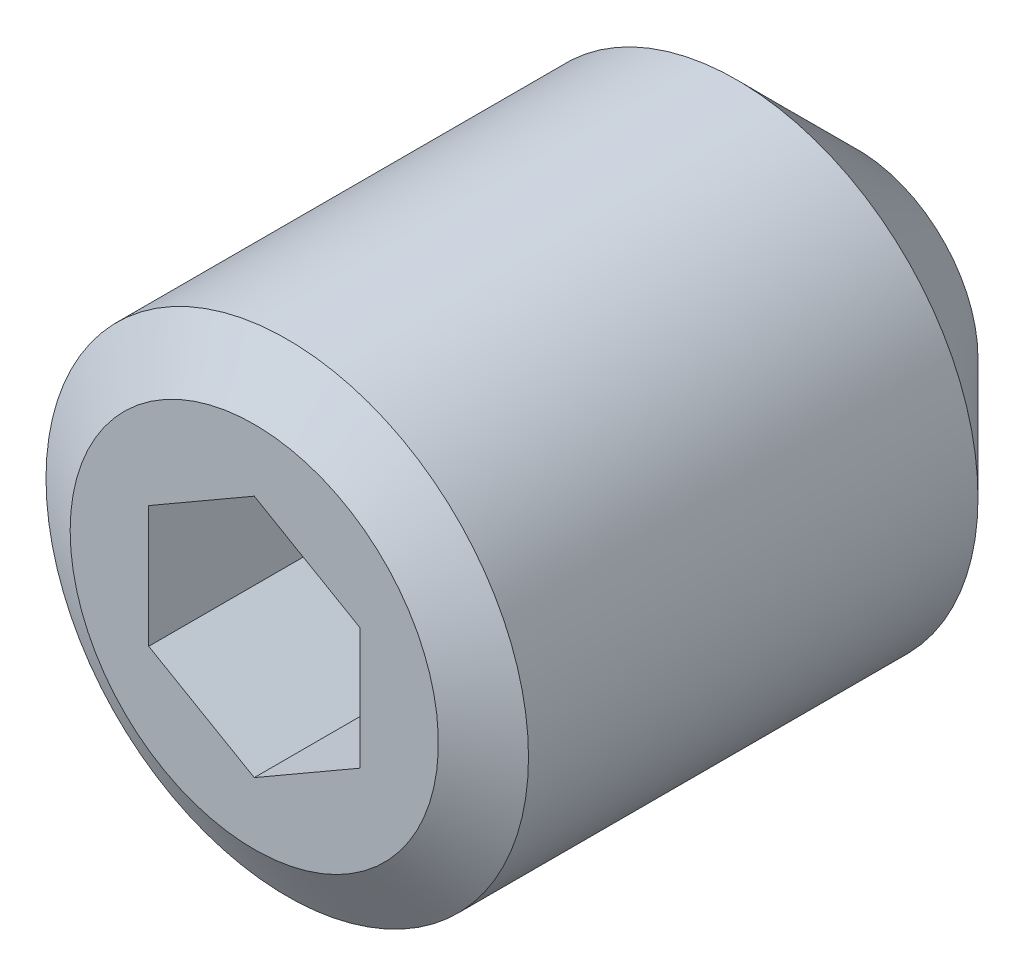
ISO-10303-21;
HEADER;
FILE_DESCRIPTION(('STEP AP214'),'2;1');
FILE_NAME('part.step','',(''),(''),'','','');
FILE_SCHEMA(('AUTOMOTIVE_DESIGN { 1 0 10303 214 1 1 1 1 }'));
ENDSEC;
DATA;
#1=APPLICATION_CONTEXT('core data for automotive mechanical design processes');
#2=APPLICATION_PROTOCOL_DEFINITION('international standard','automotive_design',2000,#1);
#3=PRODUCT_CONTEXT('',#1,'mechanical');
#4=PRODUCT('Part','Part','',(#3));
#5=PRODUCT_RELATED_PRODUCT_CATEGORY('part','',(#4));
#6=PRODUCT_DEFINITION_FORMATION('','',#4);
#7=PRODUCT_DEFINITION_CONTEXT('part definition',#1,'design');
#8=PRODUCT_DEFINITION('design','',#6,#7);
#9=PRODUCT_DEFINITION_SHAPE('','',#8);
#10=(LENGTH_UNIT() NAMED_UNIT(*) SI_UNIT(.MILLI.,.METRE.));
#11=(NAMED_UNIT(*) PLANE_ANGLE_UNIT() SI_UNIT($,.RADIAN.));
#12=(NAMED_UNIT(*) SI_UNIT($,.STERADIAN.) SOLID_ANGLE_UNIT());
#13=UNCERTAINTY_MEASURE_WITH_UNIT(LENGTH_MEASURE(1.E-05),#10,'distance_accuracy_value','');
#14=(GEOMETRIC_REPRESENTATION_CONTEXT(3) GLOBAL_UNCERTAINTY_ASSIGNED_CONTEXT((#13)) GLOBAL_UNIT_ASSIGNED_CONTEXT((#10,
#11,#12)) REPRESENTATION_CONTEXT('',''));
#15=CARTESIAN_POINT('',(0.,0.,0.));
#16=DIRECTION('',(0.,0.,1.));
#17=DIRECTION('',(1.,0.,0.));
#18=AXIS2_PLACEMENT_3D('',#15,#16,#17);
#19=CARTESIAN_POINT('',(0.349999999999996,0.202072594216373,-0.7));
#20=DIRECTION('',(0.500000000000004,0.866025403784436,0.));
#21=DIRECTION('',(-0.866025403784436,0.500000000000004,0.));
#22=AXIS2_PLACEMENT_3D('',#19,#20,#21);
#23=PLANE('',#22);
#24=CARTESIAN_POINT('',(0.350199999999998,0.201957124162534,-0.70013526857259));
#25=CARTESIAN_POINT('',(0.334815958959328,0.21083910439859,-0.705268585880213));
#26=CARTESIAN_POINT('',(0.319299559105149,0.219797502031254,-0.709938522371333));
#27=CARTESIAN_POINT('',(0.287997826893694,0.237869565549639,-0.718091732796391));
#28=CARTESIAN_POINT('',(0.272211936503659,0.246983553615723,-0.721572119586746));
#29=CARTESIAN_POINT('',(0.240835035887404,0.265099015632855,-0.726991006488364));
#30=CARTESIAN_POINT('',(0.225248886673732,0.274097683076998,-0.728965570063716));
#31=CARTESIAN_POINT('',(0.194006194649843,0.292135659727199,-0.731331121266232));
#32=CARTESIAN_POINT('',(0.178349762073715,0.301174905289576,-0.731724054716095));
#33=CARTESIAN_POINT('',(0.135419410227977,0.325960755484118,-0.730550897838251));
#34=CARTESIAN_POINT('',(0.108169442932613,0.341693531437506,-0.727309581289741));
#35=CARTESIAN_POINT('',(0.0674935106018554,0.365177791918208,-0.719313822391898));
#36=CARTESIAN_POINT('',(0.0538146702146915,0.373075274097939,-0.716071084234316));
#37=CARTESIAN_POINT('',(0.0266615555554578,0.388752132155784,-0.708710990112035));
#38=CARTESIAN_POINT('',(0.0131869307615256,0.39653171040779,-0.704595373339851));
#39=CARTESIAN_POINT('',(-0.000200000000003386,0.404260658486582,-0.700135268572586));
#40=B_SPLINE_CURVE_WITH_KNOTS('',3,(#24,#25,#26,#27,#28,#29,#30,#31,#32,#33,#34,#35,#36,#37,#38,
#39),.UNSPECIFIED.,.F.,.F.,(4,2,2,2,2,2,2,4),(0.,0.0554936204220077,0.111120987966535,
0.165370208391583,0.219552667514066,0.314051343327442,0.362406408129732,0.410666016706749),.UNSPECIFIED.);
#41=CARTESIAN_POINT('',(0.349999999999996,0.202072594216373,-0.700201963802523));
#42=VERTEX_POINT('',#41);
#43=CARTESIAN_POINT('',(0.,0.404145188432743,-0.700201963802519));
#44=VERTEX_POINT('',#43);
#45=EDGE_CURVE('E53',#42,#44,#40,.T.);
#46=ORIENTED_EDGE('',*,*,#45,.F.);
#47=DIRECTION('',(0.,0.,1.));
#48=VECTOR('',#47,1.);
#49=CARTESIAN_POINT('',(0.349999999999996,0.202072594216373,-0.7));
#50=LINE('',#49,#48);
#51=CARTESIAN_POINT('',(0.349999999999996,0.202072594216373,0.));
#52=VERTEX_POINT('',#51);
#53=EDGE_CURVE('E211',#42,#52,#50,.T.);
#54=ORIENTED_EDGE('',*,*,#53,.T.);
#55=DIRECTION('',(-0.866025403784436,0.500000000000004,0.));
#56=VECTOR('',#55,1.);
#57=CARTESIAN_POINT('',(0.349999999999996,0.202072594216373,0.));
#58=LINE('',#57,#56);
#59=CARTESIAN_POINT('',(0.,0.404145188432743,0.));
#60=VERTEX_POINT('',#59);
#61=EDGE_CURVE('E192',#52,#60,#58,.T.);
#62=ORIENTED_EDGE('',*,*,#61,.T.);
#63=DIRECTION('',(0.,0.,1.));
#64=VECTOR('',#63,1.);
#65=CARTESIAN_POINT('',(0.,0.404145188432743,-0.7));
#66=LINE('',#65,#64);
#67=EDGE_CURVE('E210',#44,#60,#66,.T.);
#68=ORIENTED_EDGE('',*,*,#67,.F.);
#69=EDGE_LOOP('',(#46,#54,#62,#68));
#70=FACE_BOUND('',#69,.T.);
#71=ADVANCED_FACE('F38',(#70),#23,.F.);
#72=CARTESIAN_POINT('',(0.349999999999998,-0.202072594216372,-0.7));
#73=DIRECTION('',(1.,0.,0.));
#74=DIRECTION('',(0.,1.,0.));
#75=AXIS2_PLACEMENT_3D('',#72,#73,#74);
#76=PLANE('',#75);
#77=CARTESIAN_POINT('',(0.349999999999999,-0.523390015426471,-0.570016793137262));
#78=CARTESIAN_POINT('',(0.349999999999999,-0.493147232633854,-0.58448680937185));
#79=CARTESIAN_POINT('',(0.349999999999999,-0.462770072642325,-0.598716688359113));
#80=CARTESIAN_POINT('',(0.349999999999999,-0.401392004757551,-0.626280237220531));
#81=CARTESIAN_POINT('',(0.349999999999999,-0.370388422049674,-0.639607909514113));
#82=CARTESIAN_POINT('',(0.349999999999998,-0.306949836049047,-0.665090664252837));
#83=CARTESIAN_POINT('',(0.349999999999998,-0.274498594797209,-0.677206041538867));
#84=CARTESIAN_POINT('',(0.349999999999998,-0.208759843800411,-0.698764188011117));
#85=CARTESIAN_POINT('',(0.349999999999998,-0.175474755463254,-0.708213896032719));
#86=CARTESIAN_POINT('',(0.349999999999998,-0.124877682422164,-0.719174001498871));
#87=CARTESIAN_POINT('',(0.349999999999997,-0.107917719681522,-0.722290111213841));
#88=CARTESIAN_POINT('',(0.349999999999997,-0.0738074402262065,-0.727238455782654));
#89=CARTESIAN_POINT('',(0.349999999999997,-0.0566571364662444,-0.729070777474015));
#90=CARTESIAN_POINT('',(0.349999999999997,-0.0224688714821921,-0.73128088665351));
#91=CARTESIAN_POINT('',(0.349999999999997,-0.00543206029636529,-0.731675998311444));
#92=CARTESIAN_POINT('',(0.349999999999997,0.0286173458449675,-0.731027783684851));
#93=CARTESIAN_POINT('',(0.349999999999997,0.045629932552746,-0.729984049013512));
#94=CARTESIAN_POINT('',(0.349999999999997,0.112601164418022,-0.723164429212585));
#95=CARTESIAN_POINT('',(0.349999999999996,0.162027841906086,-0.712127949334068));
#96=CARTESIAN_POINT('',(0.349999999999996,0.23498193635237,-0.690460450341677));
#97=CARTESIAN_POINT('',(0.349999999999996,0.259379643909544,-0.682258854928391));
#98=CARTESIAN_POINT('',(0.349999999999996,0.307750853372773,-0.664671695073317));
#99=CARTESIAN_POINT('',(0.349999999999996,0.331724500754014,-0.655286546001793));
#100=CARTESIAN_POINT('',(0.349999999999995,0.392712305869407,-0.630201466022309));
#101=CARTESIAN_POINT('',(0.349999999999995,0.429480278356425,-0.613917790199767));
#102=CARTESIAN_POINT('',(0.349999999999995,0.502491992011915,-0.580205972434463));
#103=CARTESIAN_POINT('',(0.349999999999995,0.538735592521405,-0.562777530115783));
#104=CARTESIAN_POINT('',(0.349999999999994,0.610909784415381,-0.527186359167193));
#105=CARTESIAN_POINT('',(0.349999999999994,0.646839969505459,-0.509022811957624));
#106=CARTESIAN_POINT('',(0.349999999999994,0.71845937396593,-0.472225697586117));
#107=CARTESIAN_POINT('',(0.349999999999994,0.754148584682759,-0.453592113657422));
#108=CARTESIAN_POINT('',(0.349999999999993,0.854236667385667,-0.400766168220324));
#109=CARTESIAN_POINT('',(0.349999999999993,0.918444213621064,-0.366211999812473));
#110=CARTESIAN_POINT('',(0.349999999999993,1.01444060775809,-0.31399767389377));
#111=CARTESIAN_POINT('',(0.349999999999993,1.04634673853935,-0.29655137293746));
#112=CARTESIAN_POINT('',(0.349999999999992,1.11009448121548,-0.261545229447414));
#113=CARTESIAN_POINT('',(0.349999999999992,1.14193609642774,-0.243985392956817));
#114=CARTESIAN_POINT('',(0.349999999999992,1.17375370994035,-0.226381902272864));
#115=B_SPLINE_CURVE_WITH_KNOTS('',3,(#77,#78,#79,#80,#81,#82,#83,#84,#85,#86,#87,#88,#89,#90,
#91,#92,#93,#94,#95,#96,#97,#98,#99,#100,#101,#102,#103,#104,#105,#106,#107,#108,#109,#110,#111,
#112,#113,#114),.UNSPECIFIED.,.F.,.F.,(4,2,2,2,2,2,2,2,2,2,2,2,2,2,2,2,2,2,4),(0.,
0.100605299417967,0.201824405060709,0.305686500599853,0.409275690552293,0.46096695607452,
0.512654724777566,0.563717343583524,0.614794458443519,0.765603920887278,0.842832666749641,
0.920034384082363,1.04064022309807,1.16127783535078,1.28205369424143,1.402833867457,
1.62157221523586,1.73066561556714,1.83975325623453),.UNSPECIFIED.);
#116=CARTESIAN_POINT('',(0.349999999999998,-0.202072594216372,-0.700201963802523));
#117=VERTEX_POINT('',#116);
#118=EDGE_CURVE('E60',#117,#42,#115,.T.);
#119=ORIENTED_EDGE('',*,*,#118,.F.);
#120=DIRECTION('',(0.,0.,1.));
#121=VECTOR('',#120,1.);
#122=CARTESIAN_POINT('',(0.349999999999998,-0.202072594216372,-0.7));
#123=LINE('',#122,#121);
#124=CARTESIAN_POINT('',(0.349999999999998,-0.202072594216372,0.));
#125=VERTEX_POINT('',#124);
#126=EDGE_CURVE('E213',#117,#125,#123,.T.);
#127=ORIENTED_EDGE('',*,*,#126,.T.);
#128=DIRECTION('',(0.,1.,0.));
#129=VECTOR('',#128,1.);
#130=CARTESIAN_POINT('',(0.349999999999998,-0.202072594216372,0.));
#131=LINE('',#130,#129);
#132=EDGE_CURVE('E207',#125,#52,#131,.T.);
#133=ORIENTED_EDGE('',*,*,#132,.T.);
#134=ORIENTED_EDGE('',*,*,#53,.F.);
#135=EDGE_LOOP('',(#119,#127,#133,#134));
#136=FACE_BOUND('',#135,.T.);
#137=ADVANCED_FACE('F165',(#136),#76,.F.);
#138=CARTESIAN_POINT('',(0.,-0.40414518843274,-0.7));
#139=DIRECTION('',(0.499999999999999,-0.866025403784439,0.));
#140=DIRECTION('',(0.866025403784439,0.499999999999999,0.));
#141=AXIS2_PLACEMENT_3D('',#138,#139,#140);
#142=PLANE('',#141);
#143=CARTESIAN_POINT('',(-0.000200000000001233,-0.404260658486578,-0.700135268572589));
#144=CARTESIAN_POINT('',(0.015184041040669,-0.395378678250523,-0.705268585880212));
#145=CARTESIAN_POINT('',(0.0307004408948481,-0.386420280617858,-0.709938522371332));
#146=CARTESIAN_POINT('',(0.0620021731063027,-0.368348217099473,-0.71809173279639));
#147=CARTESIAN_POINT('',(0.0777880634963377,-0.359234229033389,-0.721572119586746));
#148=CARTESIAN_POINT('',(0.109164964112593,-0.341118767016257,-0.726991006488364));
#149=CARTESIAN_POINT('',(0.124751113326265,-0.332120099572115,-0.728965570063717));
#150=CARTESIAN_POINT('',(0.155993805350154,-0.314082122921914,-0.731331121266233));
#151=CARTESIAN_POINT('',(0.171650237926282,-0.305042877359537,-0.731724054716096));
#152=CARTESIAN_POINT('',(0.21458058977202,-0.280257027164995,-0.730550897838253));
#153=CARTESIAN_POINT('',(0.241830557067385,-0.264524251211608,-0.727309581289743));
#154=CARTESIAN_POINT('',(0.282506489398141,-0.241039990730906,-0.7193138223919));
#155=CARTESIAN_POINT('',(0.296185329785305,-0.233142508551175,-0.716071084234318));
#156=CARTESIAN_POINT('',(0.323338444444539,-0.21746565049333,-0.708710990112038));
#157=CARTESIAN_POINT('',(0.336813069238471,-0.209686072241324,-0.704595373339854));
#158=CARTESIAN_POINT('',(0.3502,-0.201957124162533,-0.700135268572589));
#159=B_SPLINE_CURVE_WITH_KNOTS('',3,(#143,#144,#145,#146,#147,#148,#149,#150,#151,#152,#153,
#154,#155,#156,#157,#158),.UNSPECIFIED.,.F.,.F.,(4,2,2,2,2,2,2,4),(0.,0.055493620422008,
0.111120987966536,0.165370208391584,0.219552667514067,0.314051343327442,0.362406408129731,
0.410666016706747),.UNSPECIFIED.);
#160=CARTESIAN_POINT('',(0.,-0.40414518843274,-0.700201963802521));
#161=VERTEX_POINT('',#160);
#162=EDGE_CURVE('E182',#161,#117,#159,.T.);
#163=ORIENTED_EDGE('',*,*,#162,.F.);
#164=DIRECTION('',(0.,0.,1.));
#165=VECTOR('',#164,1.);
#166=CARTESIAN_POINT('',(0.,-0.40414518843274,-0.7));
#167=LINE('',#166,#165);
#168=CARTESIAN_POINT('',(0.,-0.40414518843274,0.));
#169=VERTEX_POINT('',#168);
#170=EDGE_CURVE('E215',#161,#169,#167,.T.);
#171=ORIENTED_EDGE('',*,*,#170,.T.);
#172=DIRECTION('',(0.866025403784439,0.499999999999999,0.));
#173=VECTOR('',#172,1.);
#174=CARTESIAN_POINT('',(0.,-0.40414518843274,0.));
#175=LINE('',#174,#173);
#176=EDGE_CURVE('E204',#169,#125,#175,.T.);
#177=ORIENTED_EDGE('',*,*,#176,.T.);
#178=ORIENTED_EDGE('',*,*,#126,.F.);
#179=EDGE_LOOP('',(#163,#171,#177,#178));
#180=FACE_BOUND('',#179,.T.);
#181=ADVANCED_FACE('F169',(#180),#142,.F.);
#182=CARTESIAN_POINT('',(-0.350000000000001,-0.20207259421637,-0.7));
#183=DIRECTION('',(-0.500000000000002,-0.866025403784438,0.));
#184=DIRECTION('',(0.866025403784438,-0.500000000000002,0.));
#185=AXIS2_PLACEMENT_3D('',#182,#183,#184);
#186=PLANE('',#185);
#187=CARTESIAN_POINT('',(-0.350200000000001,-0.201957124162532,-0.700135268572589));
#188=CARTESIAN_POINT('',(-0.334815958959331,-0.210839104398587,-0.705268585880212));
#189=CARTESIAN_POINT('',(-0.319299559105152,-0.219797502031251,-0.709938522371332));
#190=CARTESIAN_POINT('',(-0.287997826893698,-0.237869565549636,-0.71809173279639));
#191=CARTESIAN_POINT('',(-0.272211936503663,-0.246983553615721,-0.721572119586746));
#192=CARTESIAN_POINT('',(-0.240835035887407,-0.265099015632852,-0.726991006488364));
#193=CARTESIAN_POINT('',(-0.225248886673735,-0.274097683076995,-0.728965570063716));
#194=CARTESIAN_POINT('',(-0.194006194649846,-0.292135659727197,-0.731331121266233));
#195=CARTESIAN_POINT('',(-0.178349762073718,-0.301174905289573,-0.731724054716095));
#196=CARTESIAN_POINT('',(-0.13541941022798,-0.325960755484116,-0.730550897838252));
#197=CARTESIAN_POINT('',(-0.108169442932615,-0.341693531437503,-0.727309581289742));
#198=CARTESIAN_POINT('',(-0.0674935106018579,-0.365177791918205,-0.719313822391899));
#199=CARTESIAN_POINT('',(-0.0538146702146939,-0.373075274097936,-0.716071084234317));
#200=CARTESIAN_POINT('',(-0.0266615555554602,-0.388752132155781,-0.708710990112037));
#201=CARTESIAN_POINT('',(-0.0131869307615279,-0.396531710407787,-0.704595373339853));
#202=CARTESIAN_POINT('',(0.00020000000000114,-0.404260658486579,-0.700135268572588));
#203=B_SPLINE_CURVE_WITH_KNOTS('',3,(#187,#188,#189,#190,#191,#192,#193,#194,#195,#196,#197,
#198,#199,#200,#201,#202),.UNSPECIFIED.,.F.,.F.,(4,2,2,2,2,2,2,4),(0.,0.0554936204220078,
0.111120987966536,0.165370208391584,0.219552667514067,0.314051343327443,0.362406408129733,
0.41066601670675),.UNSPECIFIED.);
#204=CARTESIAN_POINT('',(-0.350000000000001,-0.20207259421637,-0.700201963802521));
#205=VERTEX_POINT('',#204);
#206=EDGE_CURVE('E107',#205,#161,#203,.T.);
#207=ORIENTED_EDGE('',*,*,#206,.F.);
#208=DIRECTION('',(0.,0.,1.));
#209=VECTOR('',#208,1.);
#210=CARTESIAN_POINT('',(-0.350000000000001,-0.20207259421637,-0.7));
#211=LINE('',#210,#209);
#212=CARTESIAN_POINT('',(-0.350000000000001,-0.20207259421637,0.));
#213=VERTEX_POINT('',#212);
#214=EDGE_CURVE('E217',#205,#213,#211,.T.);
#215=ORIENTED_EDGE('',*,*,#214,.T.);
#216=DIRECTION('',(0.866025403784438,-0.500000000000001,0.));
#217=VECTOR('',#216,1.);
#218=CARTESIAN_POINT('',(-0.350000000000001,-0.20207259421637,0.));
#219=LINE('',#218,#217);
#220=EDGE_CURVE('E201',#213,#169,#219,.T.);
#221=ORIENTED_EDGE('',*,*,#220,.T.);
#222=ORIENTED_EDGE('',*,*,#170,.F.);
#223=EDGE_LOOP('',(#207,#215,#221,#222));
#224=FACE_BOUND('',#223,.T.);
#225=ADVANCED_FACE('F130',(#224),#186,.F.);
#226=CARTESIAN_POINT('',(-0.35,0.202072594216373,-0.7));
#227=DIRECTION('',(-1.,0.,0.));
#228=DIRECTION('',(0.,-1.,0.));
#229=AXIS2_PLACEMENT_3D('',#226,#227,#228);
#230=PLANE('',#229);
#231=CARTESIAN_POINT('',(-0.350000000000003,-0.523390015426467,-0.570016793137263));
#232=CARTESIAN_POINT('',(-0.350000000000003,-0.493147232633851,-0.58448680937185));
#233=CARTESIAN_POINT('',(-0.350000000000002,-0.462770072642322,-0.598716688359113));
#234=CARTESIAN_POINT('',(-0.350000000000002,-0.401392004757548,-0.626280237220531));
#235=CARTESIAN_POINT('',(-0.350000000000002,-0.370388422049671,-0.639607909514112));
#236=CARTESIAN_POINT('',(-0.350000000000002,-0.306949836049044,-0.665090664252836));
#237=CARTESIAN_POINT('',(-0.350000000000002,-0.274498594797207,-0.677206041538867));
#238=CARTESIAN_POINT('',(-0.350000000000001,-0.20875984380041,-0.698764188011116));
#239=CARTESIAN_POINT('',(-0.350000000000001,-0.175474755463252,-0.708213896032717));
#240=CARTESIAN_POINT('',(-0.350000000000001,-0.124877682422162,-0.71917400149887));
#241=CARTESIAN_POINT('',(-0.350000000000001,-0.10791771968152,-0.722290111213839));
#242=CARTESIAN_POINT('',(-0.350000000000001,-0.0738074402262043,-0.727238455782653));
#243=CARTESIAN_POINT('',(-0.350000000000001,-0.056657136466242,-0.729070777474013));
#244=CARTESIAN_POINT('',(-0.350000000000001,-0.0224688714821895,-0.731280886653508));
#245=CARTESIAN_POINT('',(-0.35,-0.00543206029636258,-0.731675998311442));
#246=CARTESIAN_POINT('',(-0.35,0.0286173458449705,-0.731027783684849));
#247=CARTESIAN_POINT('',(-0.35,0.0456299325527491,-0.72998404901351));
#248=CARTESIAN_POINT('',(-0.35,0.112601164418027,-0.723164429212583));
#249=CARTESIAN_POINT('',(-0.35,0.162027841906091,-0.712127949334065));
#250=CARTESIAN_POINT('',(-0.349999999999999,0.234981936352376,-0.690460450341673));
#251=CARTESIAN_POINT('',(-0.349999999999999,0.25937964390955,-0.682258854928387));
#252=CARTESIAN_POINT('',(-0.349999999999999,0.30775085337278,-0.664671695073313));
#253=CARTESIAN_POINT('',(-0.349999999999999,0.331724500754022,-0.655286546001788));
#254=CARTESIAN_POINT('',(-0.349999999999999,0.392712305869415,-0.630201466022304));
#255=CARTESIAN_POINT('',(-0.349999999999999,0.429480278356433,-0.613917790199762));
#256=CARTESIAN_POINT('',(-0.349999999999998,0.502491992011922,-0.580205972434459));
#257=CARTESIAN_POINT('',(-0.349999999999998,0.538735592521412,-0.562777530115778));
#258=CARTESIAN_POINT('',(-0.349999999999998,0.610909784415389,-0.527186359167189));
#259=CARTESIAN_POINT('',(-0.349999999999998,0.646839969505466,-0.50902281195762));
#260=CARTESIAN_POINT('',(-0.349999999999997,0.718459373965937,-0.472225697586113));
#261=CARTESIAN_POINT('',(-0.349999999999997,0.754148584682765,-0.453592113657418));
#262=CARTESIAN_POINT('',(-0.349999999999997,0.854236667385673,-0.40076616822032));
#263=CARTESIAN_POINT('',(-0.349999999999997,0.91844421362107,-0.366211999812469));
#264=CARTESIAN_POINT('',(-0.349999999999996,1.0144406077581,-0.313997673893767));
#265=CARTESIAN_POINT('',(-0.349999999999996,1.04634673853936,-0.296551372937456));
#266=CARTESIAN_POINT('',(-0.349999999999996,1.11009448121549,-0.26154522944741));
#267=CARTESIAN_POINT('',(-0.349999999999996,1.14193609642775,-0.243985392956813));
#268=CARTESIAN_POINT('',(-0.349999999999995,1.17375370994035,-0.22638190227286));
#269=B_SPLINE_CURVE_WITH_KNOTS('',3,(#231,#232,#233,#234,#235,#236,#237,#238,#239,#240,#241,
#242,#243,#244,#245,#246,#247,#248,#249,#250,#251,#252,#253,#254,#255,#256,#257,#258,#259,#260,
#261,#262,#263,#264,#265,#266,#267,#268),.UNSPECIFIED.,.F.,.F.,(4,2,2,2,2,2,2,2,2,2,2,2,2,2,2,2,
2,2,4),(0.,0.100605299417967,0.201824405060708,0.305686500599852,0.409275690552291,
0.460966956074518,0.512654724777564,0.563717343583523,0.614794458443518,0.76560392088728,
0.842832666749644,0.920034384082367,1.04064022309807,1.16127783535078,1.28205369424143,
1.402833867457,1.62157221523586,1.73066561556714,1.83975325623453),.UNSPECIFIED.);
#270=CARTESIAN_POINT('',(-0.349999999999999,0.202072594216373,-0.700201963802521));
#271=VERTEX_POINT('',#270);
#272=EDGE_CURVE('E104',#271,#205,#269,.F.);
#273=ORIENTED_EDGE('',*,*,#272,.F.);
#274=DIRECTION('',(0.,0.,1.));
#275=VECTOR('',#274,1.);
#276=CARTESIAN_POINT('',(-0.35,0.202072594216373,-0.7));
#277=LINE('',#276,#275);
#278=CARTESIAN_POINT('',(-0.35,0.202072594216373,0.));
#279=VERTEX_POINT('',#278);
#280=EDGE_CURVE('E219',#271,#279,#277,.T.);
#281=ORIENTED_EDGE('',*,*,#280,.T.);
#282=DIRECTION('',(0.,-1.,0.));
#283=VECTOR('',#282,1.);
#284=CARTESIAN_POINT('',(-0.35,0.202072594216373,0.));
#285=LINE('',#284,#283);
#286=EDGE_CURVE('E198',#279,#213,#285,.T.);
#287=ORIENTED_EDGE('',*,*,#286,.T.);
#288=ORIENTED_EDGE('',*,*,#214,.F.);
#289=EDGE_LOOP('',(#273,#281,#287,#288));
#290=FACE_BOUND('',#289,.T.);
#291=ADVANCED_FACE('F125',(#290),#230,.F.);
#292=CARTESIAN_POINT('',(0.,0.404145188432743,-0.7));
#293=DIRECTION('',(-0.500000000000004,0.866025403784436,0.));
#294=DIRECTION('',(-0.866025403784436,-0.500000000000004,0.));
#295=AXIS2_PLACEMENT_3D('',#292,#293,#294);
#296=PLANE('',#295);
#297=CARTESIAN_POINT('',(0.000199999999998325,0.404260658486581,-0.700135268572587));
#298=CARTESIAN_POINT('',(-0.0151840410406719,0.395378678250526,-0.70526858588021));
#299=CARTESIAN_POINT('',(-0.0307004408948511,0.386420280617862,-0.70993852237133));
#300=CARTESIAN_POINT('',(-0.0620021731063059,0.368348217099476,-0.718091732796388));
#301=CARTESIAN_POINT('',(-0.0777880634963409,0.359234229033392,-0.721572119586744));
#302=CARTESIAN_POINT('',(-0.109164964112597,0.34111876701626,-0.726991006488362));
#303=CARTESIAN_POINT('',(-0.124751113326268,0.332120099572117,-0.728965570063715));
#304=CARTESIAN_POINT('',(-0.155993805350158,0.314082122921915,-0.731331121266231));
#305=CARTESIAN_POINT('',(-0.171650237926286,0.305042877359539,-0.731724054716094));
#306=CARTESIAN_POINT('',(-0.214580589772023,0.280257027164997,-0.730550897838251));
#307=CARTESIAN_POINT('',(-0.241830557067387,0.26452425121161,-0.727309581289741));
#308=CARTESIAN_POINT('',(-0.282506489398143,0.241039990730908,-0.719313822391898));
#309=CARTESIAN_POINT('',(-0.296185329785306,0.233142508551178,-0.716071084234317));
#310=CARTESIAN_POINT('',(-0.323338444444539,0.217465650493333,-0.708710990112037));
#311=CARTESIAN_POINT('',(-0.336813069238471,0.209686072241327,-0.704595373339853));
#312=CARTESIAN_POINT('',(-0.3502,0.201957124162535,-0.700135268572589));
#313=B_SPLINE_CURVE_WITH_KNOTS('',3,(#297,#298,#299,#300,#301,#302,#303,#304,#305,#306,#307,
#308,#309,#310,#311,#312),.UNSPECIFIED.,.F.,.F.,(4,2,2,2,2,2,2,4),(0.,0.0554936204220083,
0.111120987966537,0.165370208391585,0.219552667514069,0.314051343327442,0.36240640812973,
0.410666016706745),.UNSPECIFIED.);
#314=EDGE_CURVE('E142',#44,#271,#313,.T.);
#315=ORIENTED_EDGE('',*,*,#314,.F.);
#316=ORIENTED_EDGE('',*,*,#67,.T.);
#317=DIRECTION('',(-0.866025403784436,-0.500000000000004,0.));
#318=VECTOR('',#317,1.);
#319=CARTESIAN_POINT('',(0.,0.404145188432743,0.));
#320=LINE('',#319,#318);
#321=EDGE_CURVE('E195',#60,#279,#320,.T.);
#322=ORIENTED_EDGE('',*,*,#321,.T.);
#323=ORIENTED_EDGE('',*,*,#280,.F.);
#324=EDGE_LOOP('',(#315,#316,#322,#323));
#325=FACE_BOUND('',#324,.T.);
#326=ADVANCED_FACE('F129',(#325),#296,.F.);
#327=CARTESIAN_POINT('',(0.,0.,0.));
#328=DIRECTION('',(0.,0.,-1.));
#329=DIRECTION('',(-1.,0.,0.));
#330=AXIS2_PLACEMENT_3D('',#327,#328,#329);
#331=PLANE('',#330);
#332=CARTESIAN_POINT('',(0.,0.,0.));
#333=DIRECTION('',(0.,0.,-1.));
#334=DIRECTION('',(-1.,0.,0.));
#335=AXIS2_PLACEMENT_3D('',#332,#333,#334);
#336=CIRCLE('',#335,0.610513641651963);
#337=CARTESIAN_POINT('',(-0.610513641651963,0.,0.));
#338=VERTEX_POINT('',#337);
#339=EDGE_CURVE('E46',#338,#338,#336,.F.);
#340=ORIENTED_EDGE('',*,*,#339,.T.);
#341=EDGE_LOOP('',(#340));
#342=FACE_BOUND('',#341,.T.);
#343=ORIENTED_EDGE('',*,*,#321,.F.);
#344=ORIENTED_EDGE('',*,*,#61,.F.);
#345=ORIENTED_EDGE('',*,*,#132,.F.);
#346=ORIENTED_EDGE('',*,*,#176,.F.);
#347=ORIENTED_EDGE('',*,*,#220,.F.);
#348=ORIENTED_EDGE('',*,*,#286,.F.);
#349=EDGE_LOOP('',(#343,#344,#345,#346,#347,#348));
#350=FACE_BOUND('',#349,.T.);
#351=ADVANCED_FACE('F137',(#342,#350),#331,.F.);
#352=CARTESIAN_POINT('',(0.,0.,43.1034775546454));
#353=DIRECTION('',(0.,0.,1.));
#354=DIRECTION('',(1.,0.,0.));
#355=AXIS2_PLACEMENT_3D('',#352,#353,#354);
#356=CYLINDRICAL_SURFACE('',#355,0.799999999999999);
#357=CARTESIAN_POINT('',(0.,0.,-0.109400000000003));
#358=DIRECTION('',(0.,0.,-1.));
#359=DIRECTION('',(-1.,0.,0.));
#360=AXIS2_PLACEMENT_3D('',#357,#358,#359);
#361=CIRCLE('',#360,0.799999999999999);
#362=CARTESIAN_POINT('',(-0.799999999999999,0.,-0.109400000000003));
#363=VERTEX_POINT('',#362);
#364=EDGE_CURVE('E11',#363,#363,#361,.T.);
#365=ORIENTED_EDGE('',*,*,#364,.T.);
#366=EDGE_LOOP('',(#365));
#367=FACE_BOUND('',#366,.T.);
#368=CARTESIAN_POINT('',(0.,0.,-1.60000000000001));
#369=DIRECTION('',(0.,0.,1.));
#370=DIRECTION('',(1.,0.,0.));
#371=AXIS2_PLACEMENT_3D('',#368,#369,#370);
#372=CIRCLE('',#371,0.799999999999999);
#373=CARTESIAN_POINT('',(0.799999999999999,0.,-1.60000000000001));
#374=VERTEX_POINT('',#373);
#375=EDGE_CURVE('E149',#374,#374,#372,.T.);
#376=ORIENTED_EDGE('',*,*,#375,.T.);
#377=EDGE_LOOP('',(#376));
#378=FACE_BOUND('',#377,.T.);
#379=ADVANCED_FACE('F253',(#367,#378),#356,.T.);
#380=CARTESIAN_POINT('',(0.,0.,-2.));
#381=DIRECTION('',(0.,0.,1.));
#382=DIRECTION('',(1.,0.,0.));
#383=AXIS2_PLACEMENT_3D('',#380,#381,#382);
#384=CONICAL_SURFACE('',#383,0.4,0.785398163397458);
#385=ORIENTED_EDGE('',*,*,#375,.F.);
#386=EDGE_LOOP('',(#385));
#387=FACE_BOUND('',#386,.T.);
#388=CARTESIAN_POINT('',(0.,0.,-2.));
#389=DIRECTION('',(0.,0.,1.));
#390=DIRECTION('',(1.,0.,0.));
#391=AXIS2_PLACEMENT_3D('',#388,#389,#390);
#392=CIRCLE('',#391,0.4);
#393=CARTESIAN_POINT('',(0.4,0.,-2.));
#394=VERTEX_POINT('',#393);
#395=EDGE_CURVE('E102',#394,#394,#392,.T.);
#396=ORIENTED_EDGE('',*,*,#395,.T.);
#397=EDGE_LOOP('',(#396));
#398=FACE_BOUND('',#397,.T.);
#399=ADVANCED_FACE('F161',(#387,#398),#384,.T.);
#400=CARTESIAN_POINT('',(0.,0.,-0.699999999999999));
#401=DIRECTION('',(0.,0.,1.));
#402=DIRECTION('',(1.,0.,0.));
#403=AXIS2_PLACEMENT_3D('',#400,#401,#402);
#404=CONICAL_SURFACE('',#403,0.404494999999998,1.04719755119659);
#405=CARTESIAN_POINT('',(0.,0.,-0.93353529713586));
#406=VERTEX_POINT('',#405);
#407=VERTEX_LOOP('',#406);
#408=FACE_BOUND('',#407,.T.);
#409=ORIENTED_EDGE('',*,*,#118,.T.);
#410=ORIENTED_EDGE('',*,*,#45,.T.);
#411=ORIENTED_EDGE('',*,*,#314,.T.);
#412=ORIENTED_EDGE('',*,*,#272,.T.);
#413=ORIENTED_EDGE('',*,*,#206,.T.);
#414=ORIENTED_EDGE('',*,*,#162,.T.);
#415=EDGE_LOOP('',(#409,#410,#411,#412,#413,#414));
#416=FACE_BOUND('',#415,.T.);
#417=ADVANCED_FACE('F122',(#408,#416),#404,.F.);
#418=CARTESIAN_POINT('',(0.,0.,0.));
#419=DIRECTION('',(0.,0.,-1.));
#420=DIRECTION('',(-1.,0.,0.));
#421=AXIS2_PLACEMENT_3D('',#418,#419,#420);
#422=CONICAL_SURFACE('',#421,0.610513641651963,1.04719755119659);
#423=ORIENTED_EDGE('',*,*,#364,.F.);
#424=EDGE_LOOP('',(#423));
#425=FACE_BOUND('',#424,.T.);
#426=ORIENTED_EDGE('',*,*,#339,.F.);
#427=EDGE_LOOP('',(#426));
#428=FACE_BOUND('',#427,.T.);
#429=ADVANCED_FACE('F40',(#425,#428),#422,.T.);
#430=CARTESIAN_POINT('',(0.,0.,-2.));
#431=DIRECTION('',(0.,0.,-1.));
#432=DIRECTION('',(-1.,0.,0.));
#433=AXIS2_PLACEMENT_3D('',#430,#431,#432);
#434=CONICAL_SURFACE('',#433,0.4,1.04719755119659);
#435=CARTESIAN_POINT('',(0.,0.,-1.76905989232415));
#436=VERTEX_POINT('',#435);
#437=VERTEX_LOOP('',#436);
#438=FACE_BOUND('',#437,.T.);
#439=ORIENTED_EDGE('',*,*,#395,.F.);
#440=EDGE_LOOP('',(#439));
#441=FACE_BOUND('',#440,.T.);
#442=ADVANCED_FACE('F96',(#438,#441),#434,.F.);
#443=CLOSED_SHELL('',(#71,#137,#181,#225,#291,#326,#351,#379,#399,#417,#429,#442));
#444=MANIFOLD_SOLID_BREP('B2',#443);
#445=ADVANCED_BREP_SHAPE_REPRESENTATION('',(#18,#444),#14);
#446=SHAPE_DEFINITION_REPRESENTATION(#9,#445);
ENDSEC;
END-ISO-10303-21;
